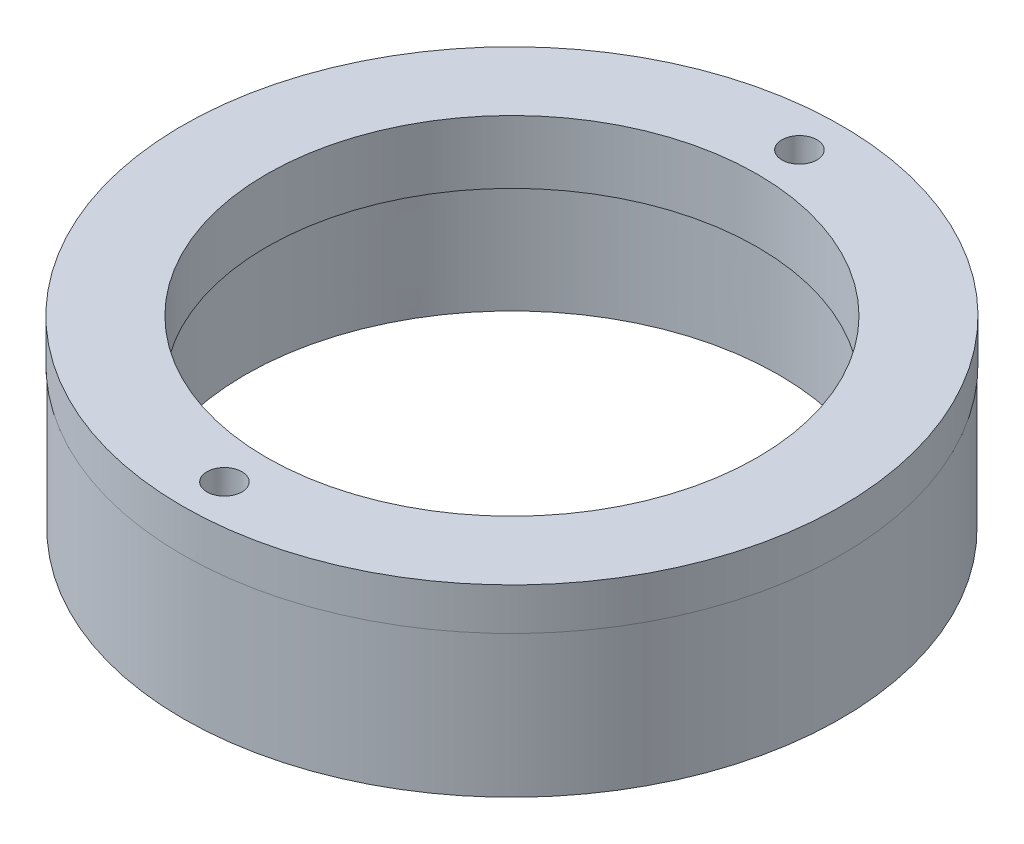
ISO-10303-21;
HEADER;
FILE_DESCRIPTION(('STEP AP214'),'2;1');
FILE_NAME('part.step','',(''),(''),'','','');
FILE_SCHEMA(('AUTOMOTIVE_DESIGN { 1 0 10303 214 1 1 1 1 }'));
ENDSEC;
DATA;
#1=APPLICATION_CONTEXT('core data for automotive mechanical design processes');
#2=APPLICATION_PROTOCOL_DEFINITION('international standard','automotive_design',2000,#1);
#3=PRODUCT_CONTEXT('',#1,'mechanical');
#4=PRODUCT('Part','Part','',(#3));
#5=PRODUCT_RELATED_PRODUCT_CATEGORY('part','',(#4));
#6=PRODUCT_DEFINITION_FORMATION('','',#4);
#7=PRODUCT_DEFINITION_CONTEXT('part definition',#1,'design');
#8=PRODUCT_DEFINITION('design','',#6,#7);
#9=PRODUCT_DEFINITION_SHAPE('','',#8);
#10=(LENGTH_UNIT() NAMED_UNIT(*) SI_UNIT(.MILLI.,.METRE.));
#11=(NAMED_UNIT(*) PLANE_ANGLE_UNIT() SI_UNIT($,.RADIAN.));
#12=(NAMED_UNIT(*) SI_UNIT($,.STERADIAN.) SOLID_ANGLE_UNIT());
#13=UNCERTAINTY_MEASURE_WITH_UNIT(LENGTH_MEASURE(1.E-05),#10,'distance_accuracy_value','');
#14=(GEOMETRIC_REPRESENTATION_CONTEXT(3) GLOBAL_UNCERTAINTY_ASSIGNED_CONTEXT((#13)) GLOBAL_UNIT_ASSIGNED_CONTEXT((#10,
#11,#12)) REPRESENTATION_CONTEXT('',''));
#15=CARTESIAN_POINT('',(0.,0.,0.));
#16=DIRECTION('',(0.,0.,1.));
#17=DIRECTION('',(1.,0.,0.));
#18=AXIS2_PLACEMENT_3D('',#15,#16,#17);
#19=CARTESIAN_POINT('',(0.,0.,0.));
#20=DIRECTION('',(0.,1.,0.));
#21=DIRECTION('',(0.,0.,1.));
#22=AXIS2_PLACEMENT_3D('',#19,#20,#21);
#23=PLANE('',#22);
#24=CARTESIAN_POINT('',(0.,0.,0.));
#25=DIRECTION('',(0.,1.,0.));
#26=DIRECTION('',(0.,0.,1.));
#27=AXIS2_PLACEMENT_3D('',#24,#25,#26);
#28=CIRCLE('',#27,11.938);
#29=CARTESIAN_POINT('',(0.,0.,11.938));
#30=VERTEX_POINT('',#29);
#31=EDGE_CURVE('E43',#30,#30,#28,.T.);
#32=ORIENTED_EDGE('',*,*,#31,.T.);
#33=EDGE_LOOP('',(#32));
#34=FACE_BOUND('',#33,.T.);
#35=CARTESIAN_POINT('',(0.,0.,0.));
#36=DIRECTION('',(0.,1.,0.));
#37=DIRECTION('',(0.,0.,1.));
#38=AXIS2_PLACEMENT_3D('',#35,#36,#37);
#39=CIRCLE('',#38,8.89);
#40=CARTESIAN_POINT('',(0.,0.,8.89));
#41=VERTEX_POINT('',#40);
#42=EDGE_CURVE('E46',#41,#41,#39,.T.);
#43=ORIENTED_EDGE('',*,*,#42,.F.);
#44=EDGE_LOOP('',(#43));
#45=FACE_BOUND('',#44,.T.);
#46=CARTESIAN_POINT('',(0.,0.,-10.414));
#47=DIRECTION('',(0.,1.,0.));
#48=DIRECTION('',(0.,0.,1.));
#49=AXIS2_PLACEMENT_3D('',#46,#47,#48);
#50=CIRCLE('',#49,0.635);
#51=CARTESIAN_POINT('',(0.,0.,-9.779));
#52=VERTEX_POINT('',#51);
#53=EDGE_CURVE('E58',#52,#52,#50,.T.);
#54=ORIENTED_EDGE('',*,*,#53,.F.);
#55=EDGE_LOOP('',(#54));
#56=FACE_BOUND('',#55,.T.);
#57=CARTESIAN_POINT('',(0.,0.,10.414));
#58=DIRECTION('',(0.,-1.,0.));
#59=DIRECTION('',(0.,0.,-1.));
#60=AXIS2_PLACEMENT_3D('',#57,#58,#59);
#61=CIRCLE('',#60,0.635);
#62=CARTESIAN_POINT('',(0.,0.,9.779));
#63=VERTEX_POINT('',#62);
#64=EDGE_CURVE('E64',#63,#63,#61,.T.);
#65=ORIENTED_EDGE('',*,*,#64,.T.);
#66=EDGE_LOOP('',(#65));
#67=FACE_BOUND('',#66,.T.);
#68=ADVANCED_FACE('F26',(#34,#45,#56,#67),#23,.T.);
#69=CARTESIAN_POINT('',(0.,-6.6802,0.));
#70=DIRECTION('',(0.,1.,0.));
#71=DIRECTION('',(0.,0.,1.));
#72=AXIS2_PLACEMENT_3D('',#69,#70,#71);
#73=CYLINDRICAL_SURFACE('',#72,11.9126);
#74=CARTESIAN_POINT('',(0.,-6.6802,0.));
#75=DIRECTION('',(0.,1.,0.));
#76=DIRECTION('',(0.,0.,1.));
#77=AXIS2_PLACEMENT_3D('',#74,#75,#76);
#78=CIRCLE('',#77,11.9126);
#79=CARTESIAN_POINT('',(0.,-6.6802,11.9126));
#80=VERTEX_POINT('',#79);
#81=EDGE_CURVE('E10',#80,#80,#78,.T.);
#82=ORIENTED_EDGE('',*,*,#81,.T.);
#83=EDGE_LOOP('',(#82));
#84=FACE_BOUND('',#83,.T.);
#85=CARTESIAN_POINT('',(0.,-1.524,0.));
#86=DIRECTION('',(0.,1.,0.));
#87=DIRECTION('',(0.,0.,1.));
#88=AXIS2_PLACEMENT_3D('',#85,#86,#87);
#89=CIRCLE('',#88,11.9126);
#90=CARTESIAN_POINT('',(0.,-1.524,11.9126));
#91=VERTEX_POINT('',#90);
#92=EDGE_CURVE('E34',#91,#91,#89,.F.);
#93=ORIENTED_EDGE('',*,*,#92,.T.);
#94=EDGE_LOOP('',(#93));
#95=FACE_BOUND('',#94,.T.);
#96=ADVANCED_FACE('F85',(#84,#95),#73,.T.);
#97=CARTESIAN_POINT('',(0.,-6.6802,0.));
#98=DIRECTION('',(0.,1.,0.));
#99=DIRECTION('',(0.,0.,1.));
#100=AXIS2_PLACEMENT_3D('',#97,#98,#99);
#101=PLANE('',#100);
#102=CARTESIAN_POINT('',(0.,-6.6802,0.));
#103=DIRECTION('',(0.,1.,0.));
#104=DIRECTION('',(0.,0.,1.));
#105=AXIS2_PLACEMENT_3D('',#102,#103,#104);
#106=CIRCLE('',#105,9.6647);
#107=CARTESIAN_POINT('',(0.,-6.6802,9.6647));
#108=VERTEX_POINT('',#107);
#109=EDGE_CURVE('E52',#108,#108,#106,.T.);
#110=ORIENTED_EDGE('',*,*,#109,.T.);
#111=EDGE_LOOP('',(#110));
#112=FACE_BOUND('',#111,.T.);
#113=ORIENTED_EDGE('',*,*,#81,.F.);
#114=EDGE_LOOP('',(#113));
#115=FACE_BOUND('',#114,.T.);
#116=ADVANCED_FACE('F93',(#112,#115),#101,.F.);
#117=CARTESIAN_POINT('',(0.,-1.524,0.));
#118=DIRECTION('',(0.,1.,0.));
#119=DIRECTION('',(0.,0.,1.));
#120=AXIS2_PLACEMENT_3D('',#117,#118,#119);
#121=CYLINDRICAL_SURFACE('',#120,11.938);
#122=CARTESIAN_POINT('',(0.,-1.524,0.));
#123=DIRECTION('',(0.,1.,0.));
#124=DIRECTION('',(0.,0.,1.));
#125=AXIS2_PLACEMENT_3D('',#122,#123,#124);
#126=CIRCLE('',#125,11.938);
#127=CARTESIAN_POINT('',(0.,-1.524,11.938));
#128=VERTEX_POINT('',#127);
#129=EDGE_CURVE('E39',#128,#128,#126,.T.);
#130=CARTESIAN_POINT('',(0.,-1.524,11.938));
#131=CARTESIAN_POINT('',(0.,-1.508125,11.938));
#132=CARTESIAN_POINT('',(0.,-1.49225,11.938));
#133=CARTESIAN_POINT('',(0.,-1.4605,11.938));
#134=CARTESIAN_POINT('',(0.,-1.444625,11.938));
#135=CARTESIAN_POINT('',(0.,-1.412875,11.938));
#136=CARTESIAN_POINT('',(0.,-1.397,11.938));
#137=CARTESIAN_POINT('',(0.,-1.36525,11.938));
#138=CARTESIAN_POINT('',(0.,-1.349375,11.938));
#139=CARTESIAN_POINT('',(0.,-1.317625,11.938));
#140=CARTESIAN_POINT('',(0.,-1.30175,11.938));
#141=CARTESIAN_POINT('',(0.,-1.27,11.938));
#142=CARTESIAN_POINT('',(0.,-1.254125,11.938));
#143=CARTESIAN_POINT('',(0.,-1.222375,11.938));
#144=CARTESIAN_POINT('',(0.,-1.2065,11.938));
#145=CARTESIAN_POINT('',(0.,-1.17475,11.938));
#146=CARTESIAN_POINT('',(0.,-1.158875,11.938));
#147=CARTESIAN_POINT('',(0.,-1.127125,11.938));
#148=CARTESIAN_POINT('',(0.,-1.11125,11.938));
#149=CARTESIAN_POINT('',(0.,-1.0795,11.938));
#150=CARTESIAN_POINT('',(0.,-1.063625,11.938));
#151=CARTESIAN_POINT('',(0.,-1.031875,11.938));
#152=CARTESIAN_POINT('',(0.,-1.016,11.938));
#153=CARTESIAN_POINT('',(0.,-0.98425,11.938));
#154=CARTESIAN_POINT('',(0.,-0.968375,11.938));
#155=CARTESIAN_POINT('',(0.,-0.936625,11.938));
#156=CARTESIAN_POINT('',(0.,-0.92075,11.938));
#157=CARTESIAN_POINT('',(0.,-0.889,11.938));
#158=CARTESIAN_POINT('',(0.,-0.873125,11.938));
#159=CARTESIAN_POINT('',(0.,-0.841375,11.938));
#160=CARTESIAN_POINT('',(0.,-0.8255,11.938));
#161=CARTESIAN_POINT('',(0.,-0.79375,11.938));
#162=CARTESIAN_POINT('',(0.,-0.777875,11.938));
#163=CARTESIAN_POINT('',(0.,-0.746125,11.938));
#164=CARTESIAN_POINT('',(0.,-0.73025,11.938));
#165=CARTESIAN_POINT('',(0.,-0.6985,11.938));
#166=CARTESIAN_POINT('',(0.,-0.682625,11.938));
#167=CARTESIAN_POINT('',(0.,-0.650875,11.938));
#168=CARTESIAN_POINT('',(0.,-0.635,11.938));
#169=CARTESIAN_POINT('',(0.,-0.60325,11.938));
#170=CARTESIAN_POINT('',(0.,-0.587375,11.938));
#171=CARTESIAN_POINT('',(0.,-0.555625,11.938));
#172=CARTESIAN_POINT('',(0.,-0.53975,11.938));
#173=CARTESIAN_POINT('',(0.,-0.508,11.938));
#174=CARTESIAN_POINT('',(0.,-0.492125,11.938));
#175=CARTESIAN_POINT('',(0.,-0.460375,11.938));
#176=CARTESIAN_POINT('',(0.,-0.4445,11.938));
#177=CARTESIAN_POINT('',(0.,-0.41275,11.938));
#178=CARTESIAN_POINT('',(0.,-0.396875,11.938));
#179=CARTESIAN_POINT('',(0.,-0.365125,11.938));
#180=CARTESIAN_POINT('',(0.,-0.34925,11.938));
#181=CARTESIAN_POINT('',(0.,-0.3175,11.938));
#182=CARTESIAN_POINT('',(0.,-0.301625,11.938));
#183=CARTESIAN_POINT('',(0.,-0.269875,11.938));
#184=CARTESIAN_POINT('',(0.,-0.254,11.938));
#185=CARTESIAN_POINT('',(0.,-0.22225,11.938));
#186=CARTESIAN_POINT('',(0.,-0.206375,11.938));
#187=CARTESIAN_POINT('',(0.,-0.174625,11.938));
#188=CARTESIAN_POINT('',(0.,-0.15875,11.938));
#189=CARTESIAN_POINT('',(0.,-0.127,11.938));
#190=CARTESIAN_POINT('',(0.,-0.111125,11.938));
#191=CARTESIAN_POINT('',(0.,-0.079375,11.938));
#192=CARTESIAN_POINT('',(0.,-0.0635,11.938));
#193=CARTESIAN_POINT('',(0.,-0.0317499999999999,11.938));
#194=CARTESIAN_POINT('',(0.,-0.015875,11.938));
#195=CARTESIAN_POINT('',(0.,0.,11.938));
#196=B_SPLINE_CURVE_WITH_KNOTS('',3,(#130,#131,#132,#133,#134,#135,#136,#137,#138,#139,#140,
#141,#142,#143,#144,#145,#146,#147,#148,#149,#150,#151,#152,#153,#154,#155,#156,#157,#158,#159,
#160,#161,#162,#163,#164,#165,#166,#167,#168,#169,#170,#171,#172,#173,#174,#175,#176,#177,#178,
#179,#180,#181,#182,#183,#184,#185,#186,#187,#188,#189,#190,#191,#192,#193,#194,#195),
.UNSPECIFIED.,.F.,.F.,(4,2,2,2,2,2,2,2,2,2,2,2,2,2,2,2,2,2,2,2,2,2,2,2,2,2,2,2,2,2,2,2,4),(0.,
0.0476249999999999,0.0952499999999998,0.142875,0.1905,0.238125,0.28575,0.333375,0.381,0.428625,
0.47625,0.523875,0.5715,0.619125,0.66675,0.714375,0.762,0.809625,0.85725,0.904875,0.9525,
1.000125,1.04775,1.095375,1.143,1.190625,1.23825,1.285875,1.3335,1.381125,1.42875,1.476375,
1.524),.UNSPECIFIED.);
#197=EDGE_CURVE('BSEAM97',#128,#30,#196,.T.);
#198=ORIENTED_EDGE('',*,*,#129,.T.);
#199=ORIENTED_EDGE('',*,*,#31,.F.);
#200=ORIENTED_EDGE('',*,*,#197,.T.);
#201=ORIENTED_EDGE('',*,*,#197,.F.);
#202=EDGE_LOOP('',(#198,#200,#199,#201));
#203=FACE_BOUND('',#202,.T.);
#204=ADVANCED_FACE('F97',(#203),#121,.T.);
#205=CARTESIAN_POINT('',(0.,-1.524,0.));
#206=DIRECTION('',(0.,1.,0.));
#207=DIRECTION('',(0.,0.,1.));
#208=AXIS2_PLACEMENT_3D('',#205,#206,#207);
#209=PLANE('',#208);
#210=ORIENTED_EDGE('',*,*,#92,.F.);
#211=EDGE_LOOP('',(#210));
#212=FACE_BOUND('',#211,.T.);
#213=ORIENTED_EDGE('',*,*,#129,.F.);
#214=EDGE_LOOP('',(#213));
#215=FACE_BOUND('',#214,.T.);
#216=ADVANCED_FACE('F106',(#212,#215),#209,.F.);
#217=CARTESIAN_POINT('',(0.,-2.286,0.));
#218=DIRECTION('',(0.,1.,0.));
#219=DIRECTION('',(0.,0.,1.));
#220=AXIS2_PLACEMENT_3D('',#217,#218,#219);
#221=CYLINDRICAL_SURFACE('',#220,8.89);
#222=CARTESIAN_POINT('',(0.,-2.286,0.));
#223=DIRECTION('',(0.,1.,0.));
#224=DIRECTION('',(0.,0.,1.));
#225=AXIS2_PLACEMENT_3D('',#222,#223,#224);
#226=CIRCLE('',#225,8.89);
#227=CARTESIAN_POINT('',(0.,-2.286,8.89));
#228=VERTEX_POINT('',#227);
#229=EDGE_CURVE('E49',#228,#228,#226,.F.);
#230=ORIENTED_EDGE('',*,*,#229,.T.);
#231=EDGE_LOOP('',(#230));
#232=FACE_BOUND('',#231,.T.);
#233=ORIENTED_EDGE('',*,*,#42,.T.);
#234=EDGE_LOOP('',(#233));
#235=FACE_BOUND('',#234,.T.);
#236=ADVANCED_FACE('F117',(#232,#235),#221,.F.);
#237=CARTESIAN_POINT('',(0.,-2.286,0.));
#238=DIRECTION('',(0.,1.,0.));
#239=DIRECTION('',(0.,0.,1.));
#240=AXIS2_PLACEMENT_3D('',#237,#238,#239);
#241=PLANE('',#240);
#242=CARTESIAN_POINT('',(0.,-2.286,0.));
#243=DIRECTION('',(0.,1.,0.));
#244=DIRECTION('',(0.,0.,1.));
#245=AXIS2_PLACEMENT_3D('',#242,#243,#244);
#246=CIRCLE('',#245,9.64552656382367);
#247=CARTESIAN_POINT('',(0.,-2.286,9.64552656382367));
#248=VERTEX_POINT('',#247);
#249=EDGE_CURVE('E30',#248,#248,#246,.T.);
#250=ORIENTED_EDGE('',*,*,#249,.F.);
#251=EDGE_LOOP('',(#250));
#252=FACE_BOUND('',#251,.T.);
#253=ORIENTED_EDGE('',*,*,#229,.F.);
#254=EDGE_LOOP('',(#253));
#255=FACE_BOUND('',#254,.T.);
#256=ADVANCED_FACE('F112',(#252,#255),#241,.F.);
#257=CARTESIAN_POINT('',(0.,-6.6802,0.));
#258=DIRECTION('',(0.,-1.,0.));
#259=DIRECTION('',(0.,0.,1.));
#260=AXIS2_PLACEMENT_3D('',#257,#258,#259);
#261=CONICAL_SURFACE('',#260,9.6647,0.00436332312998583);
#262=ORIENTED_EDGE('',*,*,#109,.F.);
#263=EDGE_LOOP('',(#262));
#264=FACE_BOUND('',#263,.T.);
#265=ORIENTED_EDGE('',*,*,#249,.T.);
#266=EDGE_LOOP('',(#265));
#267=FACE_BOUND('',#266,.T.);
#268=ADVANCED_FACE('F28',(#264,#267),#261,.F.);
#269=CARTESIAN_POINT('',(0.,-1.524,-10.414));
#270=DIRECTION('',(0.,1.,0.));
#271=DIRECTION('',(0.,0.,1.));
#272=AXIS2_PLACEMENT_3D('',#269,#270,#271);
#273=CYLINDRICAL_SURFACE('',#272,0.635);
#274=CARTESIAN_POINT('',(0.,-1.524,-10.414));
#275=DIRECTION('',(0.,1.,0.));
#276=DIRECTION('',(0.,0.,1.));
#277=AXIS2_PLACEMENT_3D('',#274,#275,#276);
#278=CIRCLE('',#277,0.635);
#279=CARTESIAN_POINT('',(0.,-1.524,-9.779));
#280=VERTEX_POINT('',#279);
#281=EDGE_CURVE('E55',#280,#280,#278,.T.);
#282=ORIENTED_EDGE('',*,*,#281,.F.);
#283=EDGE_LOOP('',(#282));
#284=FACE_BOUND('',#283,.T.);
#285=ORIENTED_EDGE('',*,*,#53,.T.);
#286=EDGE_LOOP('',(#285));
#287=FACE_BOUND('',#286,.T.);
#288=ADVANCED_FACE('F81',(#284,#287),#273,.F.);
#289=CARTESIAN_POINT('',(0.,-1.524,-10.414));
#290=DIRECTION('',(0.,1.,0.));
#291=DIRECTION('',(0.,0.,1.));
#292=AXIS2_PLACEMENT_3D('',#289,#290,#291);
#293=PLANE('',#292);
#294=ORIENTED_EDGE('',*,*,#281,.T.);
#295=EDGE_LOOP('',(#294));
#296=FACE_BOUND('',#295,.T.);
#297=ADVANCED_FACE('F72',(#296),#293,.T.);
#298=CARTESIAN_POINT('',(0.,-1.524,10.414));
#299=DIRECTION('',(0.,1.,0.));
#300=DIRECTION('',(0.,0.,1.));
#301=AXIS2_PLACEMENT_3D('',#298,#299,#300);
#302=CYLINDRICAL_SURFACE('',#301,0.635);
#303=CARTESIAN_POINT('',(0.,-1.524,10.414));
#304=DIRECTION('',(0.,-1.,0.));
#305=DIRECTION('',(0.,0.,-1.));
#306=AXIS2_PLACEMENT_3D('',#303,#304,#305);
#307=CIRCLE('',#306,0.635);
#308=CARTESIAN_POINT('',(0.,-1.524,9.779));
#309=VERTEX_POINT('',#308);
#310=EDGE_CURVE('E61',#309,#309,#307,.T.);
#311=ORIENTED_EDGE('',*,*,#310,.T.);
#312=EDGE_LOOP('',(#311));
#313=FACE_BOUND('',#312,.T.);
#314=ORIENTED_EDGE('',*,*,#64,.F.);
#315=EDGE_LOOP('',(#314));
#316=FACE_BOUND('',#315,.T.);
#317=ADVANCED_FACE('F69',(#313,#316),#302,.F.);
#318=CARTESIAN_POINT('',(0.,-1.524,10.414));
#319=DIRECTION('',(0.,-1.,0.));
#320=DIRECTION('',(0.,0.,-1.));
#321=AXIS2_PLACEMENT_3D('',#318,#319,#320);
#322=PLANE('',#321);
#323=ORIENTED_EDGE('',*,*,#310,.F.);
#324=EDGE_LOOP('',(#323));
#325=FACE_BOUND('',#324,.T.);
#326=ADVANCED_FACE('F71',(#325),#322,.F.);
#327=CLOSED_SHELL('',(#68,#96,#116,#204,#216,#236,#256,#268,#288,#297,#317,#326));
#328=MANIFOLD_SOLID_BREP('B2',#327);
#329=ADVANCED_BREP_SHAPE_REPRESENTATION('',(#18,#328),#14);
#330=SHAPE_DEFINITION_REPRESENTATION(#9,#329);
ENDSEC;
END-ISO-10303-21;
